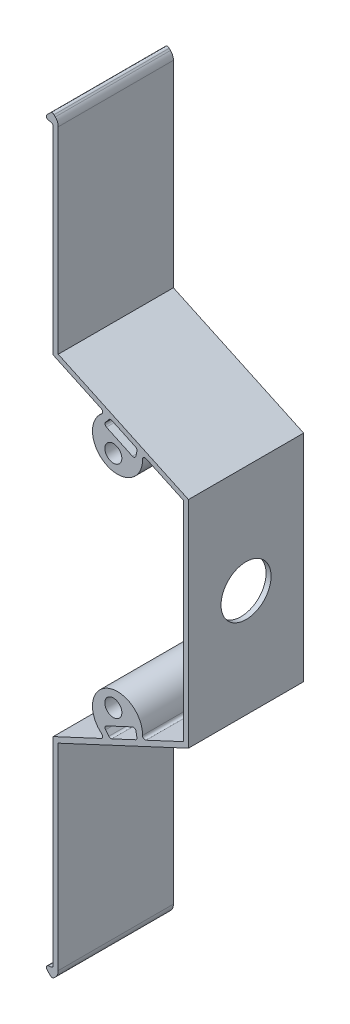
from build123d import *

# Parameters (mm, degrees)
SKETCH_1_R             = 1.7
EXTRUDE_1_DEPTH        = 23
CUT_EXTRUDE_1_DEPTH    = 23
FILLET_1_R             = 0.5
FILLET_1_OF_MIRROR_1_R = 0.5
SKETCH_3_R             = 5
CUT_EXTRUDE_2_DEPTH    = 10


with BuildPart() as part:
    # Sketch 1 → Extrude 1 (new body)
    # profile 1 of 2: a face of its own
    with BuildSketch(Plane.XY):
        with BuildLine():
            Line((120, 0), (121, 0))
            Line((121, 0), (121, 21.5))
            Line((121, 21.5), (95, 33.623999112))
            Line((95, 33.623999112), (95, 72.95836944))
            ThreePointArc((95, 72.95836944), (94.847759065, 73.723736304), (94.414213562, 74.372583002))
            Line((94.414213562, 74.372583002), (94.157172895, 74.62962367))
            ThreePointArc((94.157172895, 74.62962367), (93.803619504, 74.776070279), (93.450066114, 74.62962367))
            Line((93.450066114, 74.62962367), (92.772042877, 73.951600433))
            ThreePointArc((92.772042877, 73.951600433), (92.65283698, 73.435262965), (93.064661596, 73.101773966))
            Line((93.064661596, 73.101773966), (93.560934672, 73.040839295))
            ThreePointArc((93.560934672, 73.040839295), (93.87447786, 72.875876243), (94, 72.544566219))
            Line((94, 72.544566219), (94, 32.986928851))
            Line((94, 32.986928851), (103.587310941, 28.516292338))
            ThreePointArc((103.587310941, 28.516292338), (103.872310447, 28.123782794), (103.690207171, 27.674197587))
            ThreePointArc((103.690207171, 27.674197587), (104.719169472, 19.25325007), (111.83139374, 23.877899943))
            ThreePointArc((111.83139374, 23.877899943), (112.05874226, 24.306386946), (112.542616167, 24.34036493))
            Line((112.542616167, 24.34036493), (120, 20.862929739))
            Line((120, 20.862929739), (120, 0))
        make_face()
        with Locations(Location((106, 22, 0), (0, 0, 180))):
            Circle(SKETCH_1_R, mode=Mode.SUBTRACT)
    # profile 2 of 2: a face of its own
    with BuildSketch(Plane.XY):
        with BuildLine():
            ThreePointArc((94.414213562, -74.372583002), (94.847759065, -73.723736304), (95, -72.95836944))
            Line((95, -72.95836944), (95, -33.623999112))
            Line((95, -33.623999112), (121, -21.5))
            Line((121, -21.5), (121, 0))
            Line((121, 0), (120, 0))
            Line((120, 0), (120, -20.862929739))
            Line((120, -20.862929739), (112.542616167, -24.34036493))
            ThreePointArc((112.542616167, -24.34036493), (112.05874226, -24.306386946), (111.83139374, -23.877899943))
            ThreePointArc((111.83139374, -23.877899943), (104.719169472, -19.25325007), (103.690207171, -27.674197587))
            ThreePointArc((103.690207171, -27.674197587), (103.872310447, -28.123782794), (103.587310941, -28.516292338))
            Line((103.587310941, -28.516292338), (94, -32.986928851))
            Line((94, -32.986928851), (94, -72.544566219))
            ThreePointArc((94, -72.544566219), (93.87447786, -72.875876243), (93.560934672, -73.040839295))
            Line((93.560934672, -73.040839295), (93.064661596, -73.101773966))
            ThreePointArc((93.064661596, -73.101773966), (92.65283698, -73.435262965), (92.772042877, -73.951600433))
            Line((92.772042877, -73.951600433), (93.450066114, -74.62962367))
            ThreePointArc((93.450066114, -74.62962367), (93.803619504, -74.776070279), (94.157172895, -74.62962367))
            Line((94.157172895, -74.62962367), (94.414213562, -74.372583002))
        make_face()
        with Locations(Location((106, -22, 0), (0, 0, 180))):
            Circle(SKETCH_1_R, mode=Mode.SUBTRACT)
    extrude(amount=EXTRUDE_1_DEPTH)

    # Sketch 2 → Cut-Extrude 1 (cut)
    with BuildSketch(Plane.XY.offset(23)):
        Polygon((105.346040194, 27.696183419), (110.783886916, 25.160473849), (110.391804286, 23.136549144), (104.047649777, 26.094876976), align=None)
    cut_extrude_1 = extrude(amount=-CUT_EXTRUDE_1_DEPTH, mode=Mode.SUBTRACT)

    # Fillet 1
    fillet_1_edges = [part.edges().sort_by_distance(p)[0] for p in [
        (104.047649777, 26.094876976, 11.5),
        (105.346040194, 27.696183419, 11.5),
        (110.783886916, 25.160473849, 11.5),
        (110.391804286, 23.136549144, 11.5),
    ]]
    fillet(fillet_1_edges, radius=FILLET_1_R)

    # Mirror 1: Cut-Extrude 1 across plane
    add(cut_extrude_1.mirror(Plane.ZX), mode=Mode.SUBTRACT)

    # Fillet 1 of Mirror 1
    fillet_1_of_mirror_1_edges = [part.edges().sort_by_distance(p)[0] for p in [
        (104.047649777, -26.094876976, 11.5),
        (105.346040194, -27.696183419, 11.5),
        (110.783886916, -25.160473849, 11.5),
        (110.391804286, -23.136549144, 11.5),
    ]]
    fillet(fillet_1_of_mirror_1_edges, radius=FILLET_1_OF_MIRROR_1_R)

    # Sketch 3 → Cut-Extrude 2 (cut)
    with BuildSketch(Plane(origin=(121, 0, 0), x_dir=(0, 0, -1), z_dir=(1, 0, 0))):
        with Locations(Location((-11.5, 0, 0), (0, 0, 90))):
            Circle(SKETCH_3_R)
    extrude(amount=-CUT_EXTRUDE_2_DEPTH, mode=Mode.SUBTRACT)


solid = part.part
